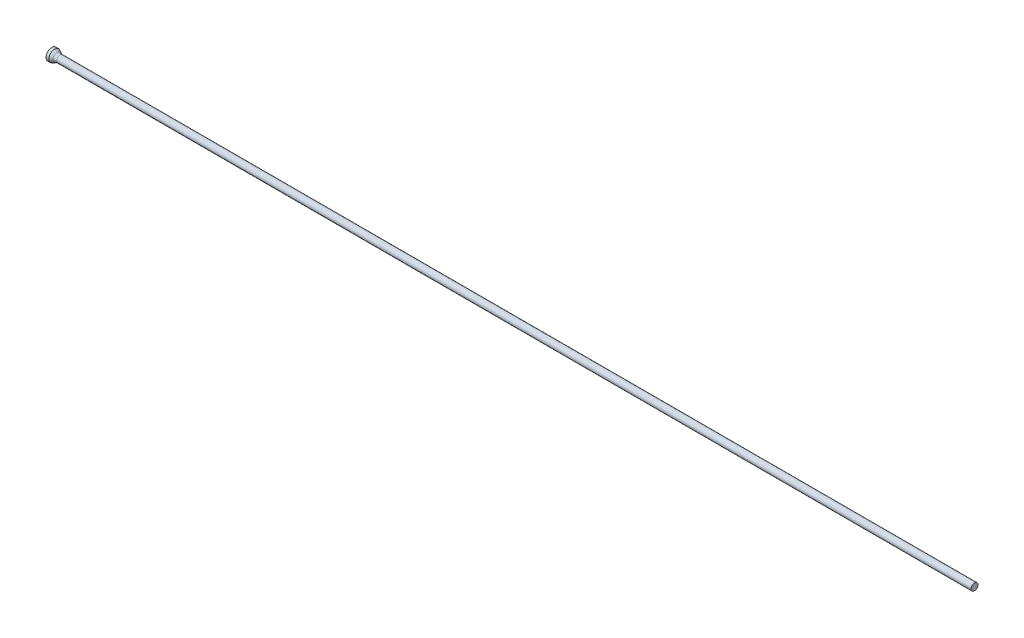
ISO-10303-21;
HEADER;
FILE_DESCRIPTION(('STEP AP214'),'2;1');
FILE_NAME('part.step','',(''),(''),'','','');
FILE_SCHEMA(('AUTOMOTIVE_DESIGN { 1 0 10303 214 1 1 1 1 }'));
ENDSEC;
DATA;
#1=APPLICATION_CONTEXT('core data for automotive mechanical design processes');
#2=APPLICATION_PROTOCOL_DEFINITION('international standard','automotive_design',2000,#1);
#3=PRODUCT_CONTEXT('',#1,'mechanical');
#4=PRODUCT('Part','Part','',(#3));
#5=PRODUCT_RELATED_PRODUCT_CATEGORY('part','',(#4));
#6=PRODUCT_DEFINITION_FORMATION('','',#4);
#7=PRODUCT_DEFINITION_CONTEXT('part definition',#1,'design');
#8=PRODUCT_DEFINITION('design','',#6,#7);
#9=PRODUCT_DEFINITION_SHAPE('','',#8);
#10=(LENGTH_UNIT() NAMED_UNIT(*) SI_UNIT(.MILLI.,.METRE.));
#11=(NAMED_UNIT(*) PLANE_ANGLE_UNIT() SI_UNIT($,.RADIAN.));
#12=(NAMED_UNIT(*) SI_UNIT($,.STERADIAN.) SOLID_ANGLE_UNIT());
#13=UNCERTAINTY_MEASURE_WITH_UNIT(LENGTH_MEASURE(1.E-05),#10,'distance_accuracy_value','');
#14=(GEOMETRIC_REPRESENTATION_CONTEXT(3) GLOBAL_UNCERTAINTY_ASSIGNED_CONTEXT((#13)) GLOBAL_UNIT_ASSIGNED_CONTEXT((#10,
#11,#12)) REPRESENTATION_CONTEXT('',''));
#15=CARTESIAN_POINT('',(0.,0.,0.));
#16=DIRECTION('',(0.,0.,1.));
#17=DIRECTION('',(1.,0.,0.));
#18=AXIS2_PLACEMENT_3D('',#15,#16,#17);
#19=CARTESIAN_POINT('',(0.,0.,0.));
#20=DIRECTION('',(1.,0.,0.));
#21=DIRECTION('',(0.,0.,-1.));
#22=AXIS2_PLACEMENT_3D('',#19,#20,#21);
#23=PLANE('',#22);
#24=CARTESIAN_POINT('',(0.,0.,0.));
#25=DIRECTION('',(-1.,0.,0.));
#26=DIRECTION('',(0.,0.,1.));
#27=AXIS2_PLACEMENT_3D('',#24,#25,#26);
#28=CIRCLE('',#27,1.);
#29=CARTESIAN_POINT('',(0.,0.,1.));
#30=VERTEX_POINT('',#29);
#31=EDGE_CURVE('E25',#30,#30,#28,.T.);
#32=ORIENTED_EDGE('',*,*,#31,.T.);
#33=EDGE_LOOP('',(#32));
#34=FACE_BOUND('',#33,.T.);
#35=ADVANCED_FACE('F14',(#34),#23,.F.);
#36=CARTESIAN_POINT('',(0.,0.,0.));
#37=DIRECTION('',(-1.,0.,0.));
#38=DIRECTION('',(0.,0.,1.));
#39=AXIS2_PLACEMENT_3D('',#36,#37,#38);
#40=CYLINDRICAL_SURFACE('',#39,1.);
#41=ORIENTED_EDGE('',*,*,#31,.F.);
#42=EDGE_LOOP('',(#41));
#43=FACE_BOUND('',#42,.T.);
#44=CARTESIAN_POINT('',(0.497179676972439,0.,0.));
#45=DIRECTION('',(-1.,0.,0.));
#46=DIRECTION('',(0.,0.,1.));
#47=AXIS2_PLACEMENT_3D('',#44,#45,#46);
#48=CIRCLE('',#47,1.);
#49=CARTESIAN_POINT('',(0.497179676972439,0.,1.));
#50=VERTEX_POINT('',#49);
#51=EDGE_CURVE('E29',#50,#50,#48,.T.);
#52=ORIENTED_EDGE('',*,*,#51,.T.);
#53=EDGE_LOOP('',(#52));
#54=FACE_BOUND('',#53,.T.);
#55=ADVANCED_FACE('F53',(#43,#54),#40,.T.);
#56=CARTESIAN_POINT('',(1.19,0.,0.));
#57=DIRECTION('',(-1.,0.,0.));
#58=DIRECTION('',(0.,0.,1.));
#59=AXIS2_PLACEMENT_3D('',#56,#57,#58);
#60=CONICAL_SURFACE('',#59,0.6,0.523598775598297);
#61=CARTESIAN_POINT('',(0.957949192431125,0.,0.));
#62=DIRECTION('',(-1.,0.,0.));
#63=DIRECTION('',(0.,0.,1.));
#64=AXIS2_PLACEMENT_3D('',#61,#62,#63);
#65=CIRCLE('',#64,0.733974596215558);
#66=CARTESIAN_POINT('',(0.957949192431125,0.,0.733974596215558));
#67=VERTEX_POINT('',#66);
#68=EDGE_CURVE('E21',#67,#67,#65,.T.);
#69=ORIENTED_EDGE('',*,*,#68,.T.);
#70=EDGE_LOOP('',(#69));
#71=FACE_BOUND('',#70,.T.);
#72=ORIENTED_EDGE('',*,*,#51,.F.);
#73=EDGE_LOOP('',(#72));
#74=FACE_BOUND('',#73,.T.);
#75=ADVANCED_FACE('F50',(#71,#74),#60,.T.);
#76=CARTESIAN_POINT('',(0.,0.,0.));
#77=DIRECTION('',(-1.,0.,0.));
#78=DIRECTION('',(0.,0.,1.));
#79=AXIS2_PLACEMENT_3D('',#76,#77,#78);
#80=CYLINDRICAL_SURFACE('',#79,0.6);
#81=CARTESIAN_POINT('',(1.45794919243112,0.,0.));
#82=DIRECTION('',(-1.,0.,0.));
#83=DIRECTION('',(0.,0.,1.));
#84=AXIS2_PLACEMENT_3D('',#81,#82,#83);
#85=CIRCLE('',#84,0.6);
#86=CARTESIAN_POINT('',(1.45794919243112,0.,0.6));
#87=VERTEX_POINT('',#86);
#88=EDGE_CURVE('E9',#87,#87,#85,.F.);
#89=ORIENTED_EDGE('',*,*,#88,.T.);
#90=EDGE_LOOP('',(#89));
#91=FACE_BOUND('',#90,.T.);
#92=CARTESIAN_POINT('',(160.,0.,0.));
#93=DIRECTION('',(-1.,0.,0.));
#94=DIRECTION('',(0.,0.,1.));
#95=AXIS2_PLACEMENT_3D('',#92,#93,#94);
#96=CIRCLE('',#95,0.6);
#97=CARTESIAN_POINT('',(160.,0.,0.6));
#98=VERTEX_POINT('',#97);
#99=EDGE_CURVE('E34',#98,#98,#96,.T.);
#100=ORIENTED_EDGE('',*,*,#99,.T.);
#101=EDGE_LOOP('',(#100));
#102=FACE_BOUND('',#101,.T.);
#103=ADVANCED_FACE('F38',(#91,#102),#80,.T.);
#104=CARTESIAN_POINT('',(160.,0.6,0.));
#105=DIRECTION('',(-1.,0.,0.));
#106=DIRECTION('',(0.,0.,1.));
#107=AXIS2_PLACEMENT_3D('',#104,#105,#106);
#108=PLANE('',#107);
#109=ORIENTED_EDGE('',*,*,#99,.F.);
#110=EDGE_LOOP('',(#109));
#111=FACE_BOUND('',#110,.T.);
#112=ADVANCED_FACE('F40',(#111),#108,.F.);
#113=CARTESIAN_POINT('',(1.45794919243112,0.,0.));
#114=DIRECTION('',(-1.,0.,0.));
#115=DIRECTION('',(0.,0.,1.));
#116=AXIS2_PLACEMENT_3D('',#113,#114,#115);
#117=TOROIDAL_SURFACE('',#116,1.6,1.);
#118=ORIENTED_EDGE('',*,*,#88,.F.);
#119=EDGE_LOOP('',(#118));
#120=FACE_BOUND('',#119,.T.);
#121=ORIENTED_EDGE('',*,*,#68,.F.);
#122=EDGE_LOOP('',(#121));
#123=FACE_BOUND('',#122,.T.);
#124=ADVANCED_FACE('F16',(#120,#123),#117,.F.);
#125=CLOSED_SHELL('',(#35,#55,#75,#103,#112,#124));
#126=MANIFOLD_SOLID_BREP('B1',#125);
#127=ADVANCED_BREP_SHAPE_REPRESENTATION('',(#18,#126),#14);
#128=SHAPE_DEFINITION_REPRESENTATION(#9,#127);
ENDSEC;
END-ISO-10303-21;
